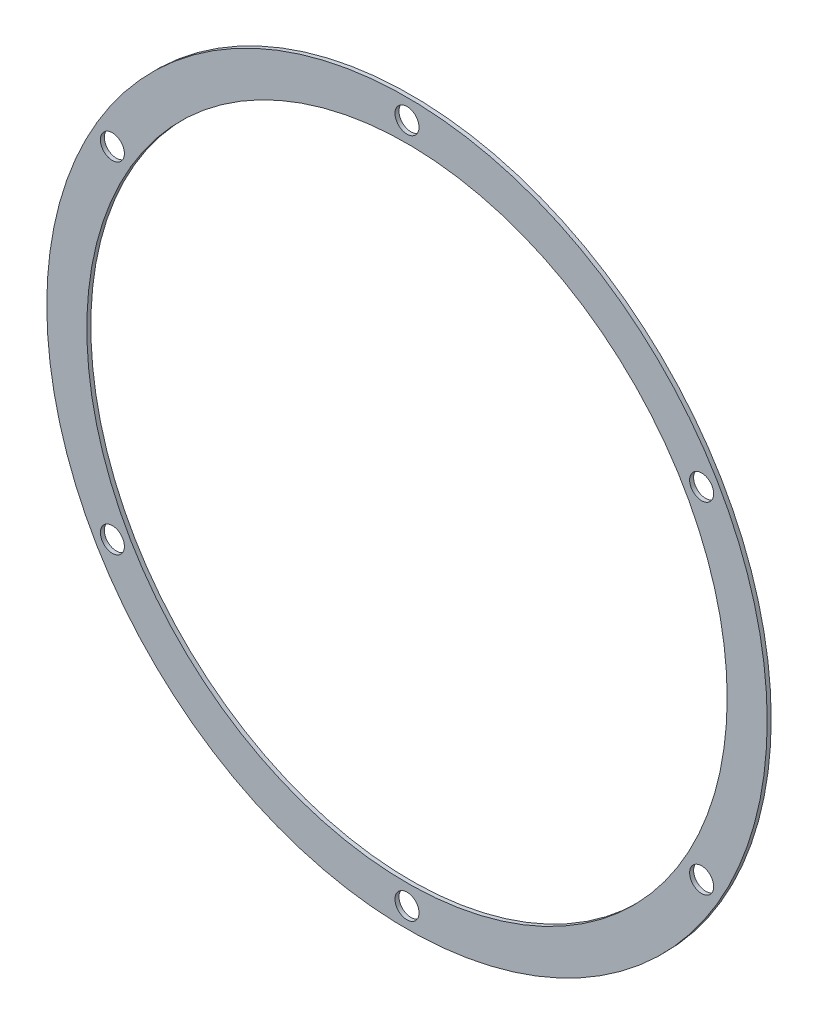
from build123d import *

# Parameters (mm, degrees)
SKETCH1_R           = 180
SKETCH1_R_2         = 160
BOSS_EXTRUDE1_DEPTH = 2
SKETCH2_R           = 6
CUT_EXTRUDE1_DEPTH  = 255.566297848
CIRPATTERN1_COUNT   = 6


with BuildPart() as part:
    # Sketch1 → Boss-Extrude1 (new body)
    with BuildSketch(Plane.XY):
        Circle(SKETCH1_R)
        Circle(SKETCH1_R_2, mode=Mode.SUBTRACT)
    extrude(amount=BOSS_EXTRUDE1_DEPTH)

    # Sketch2 → Cut-Extrude1 (cut, through all)
    with BuildSketch(Plane.XY.offset(2)):
        with Locations((0, 170)):
            Circle(SKETCH2_R)
    cut_extrude1 = extrude(amount=-CUT_EXTRUDE1_DEPTH, mode=Mode.SUBTRACT)

    # CirPattern1: Cut-Extrude1 ×6 about axis
    cirpattern1_axis = Axis((0, 0, 0), (0, 0, 1))
    for i in range(1, CIRPATTERN1_COUNT):
        add(cut_extrude1.rotate(cirpattern1_axis, i * 360 / CIRPATTERN1_COUNT), mode=Mode.SUBTRACT)


solid = part.part
